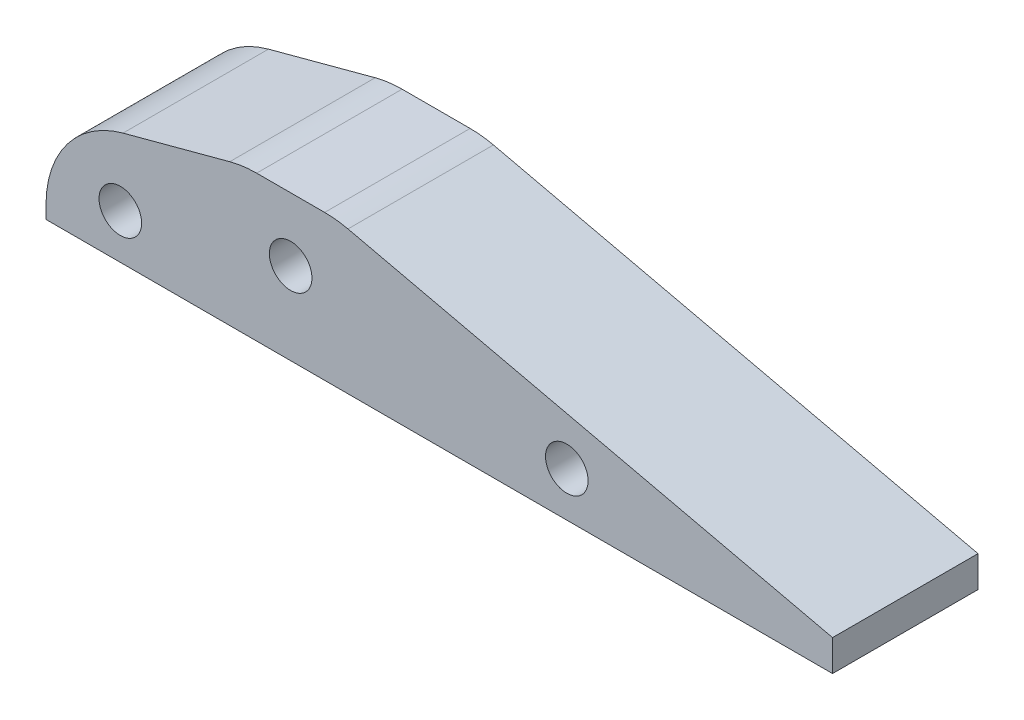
from build123d import *

# Parameters (mm, degrees)
BOSS_EXTRUDE1_DEPTH = 14
FILLET1_R           = 10
FILLET2_R           = 10
CUT_EXTRUDE1_DEPTH  = 5
SKETCH3_R           = 2.05
CUT_EXTRUDE2_DEPTH  = 78.515972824


with BuildPart() as part:
    # Sketch1 → Boss-Extrude1 (new body)
    with BuildSketch(Plane.XY):
        Polygon((0, 0), (0, 8.92), (18.958818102, 14), (27.958818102, 14), (75.708163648, 3), (75.708163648, 0), align=None)
    extrude(amount=BOSS_EXTRUDE1_DEPTH)

    # Fillet1
    fillet1_edges = [part.edges().sort_by_distance(p)[0] for p in [
        (0, 8.92, 7),
    ]]
    fillet(fillet1_edges, radius=FILLET1_R)

    # Fillet2
    fillet2_edges = [part.edges().sort_by_distance(p)[0] for p in [
        (18.958818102, 14, 7),
        (27.958818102, 14, 7),
    ]]
    fillet(fillet2_edges, radius=FILLET2_R)

    # Sketch2 → Cut-Extrude1 (cut)
    with BuildSketch(Plane(origin=(0, 0, 0), x_dir=(-1, 0, 0), z_dir=(0, 0, -1))):
        Polygon((-52.17923967, 7.843591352), (-54.228833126, 4.293591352), (-52.17923967, 0.743591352), (-48.080052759, 0.743591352), (-46.030459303, 4.293591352), (-48.080052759, 7.843591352), align=None)
        Polygon((-25.598194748, 11.456888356), (-27.647788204, 7.906888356), (-25.598194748, 4.356888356), (-21.499007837, 4.356888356), (-19.449414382, 7.906888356), (-21.499007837, 11.456888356), align=None)
        Polygon((-9.204597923, 7.843591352), (-11.254191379, 4.293591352), (-9.204597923, 0.743591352), (-5.105411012, 0.743591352), (-3.055817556, 4.293591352), (-5.105411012, 7.843591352), align=None)
    extrude(amount=-CUT_EXTRUDE1_DEPTH, mode=Mode.SUBTRACT)

    # Sketch3 → Cut-Extrude2 (cut, through all)
    with BuildSketch(Plane(origin=(0, 0, 5), x_dir=(-1, 0, 0), z_dir=(0, 0, -1))):
        with Locations((-50.129646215, 4.293591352)):
            Circle(SKETCH3_R)
        with Locations((-23.548601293, 7.906888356)):
            Circle(SKETCH3_R)
        with Locations((-7.155004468, 4.293591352)):
            Circle(SKETCH3_R)
    extrude(amount=-CUT_EXTRUDE2_DEPTH, mode=Mode.SUBTRACT)


solid = part.part
